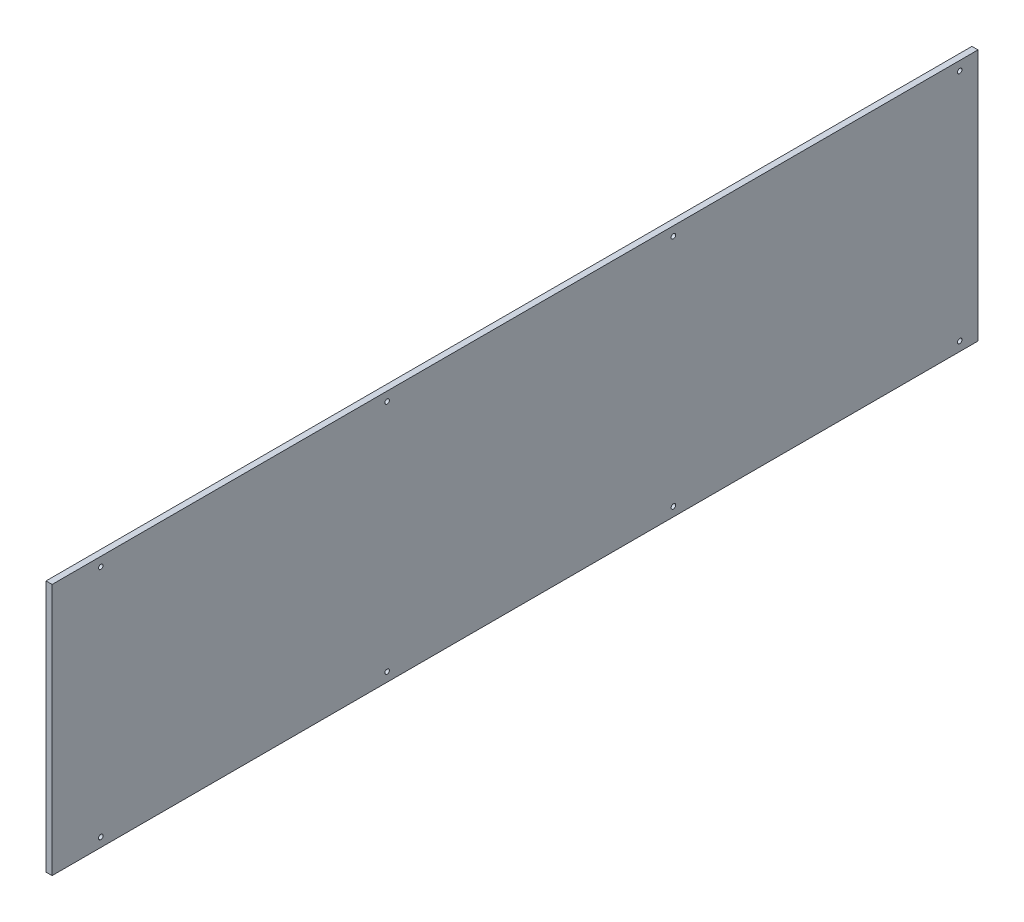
from build123d import *

# Parameters (mm, degrees)
SKETCH1_W         = 1930.4
SKETCH1_H         = 525.78
EXTRUDE1_DEPTH    = 12.7
SKETCH2_R         = 4.7625
BARREL_NUTS_DEPTH = 2001.762369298
LPATTERN1_COUNT   = 4
LPATTERN1_PITCH   = 596.9


with BuildPart() as part:
    # Sketch1 → Extrude1 (new body)
    with BuildSketch(Plane(origin=(0, 0, 0), x_dir=(0, 0, -1), z_dir=(1, 0, 0))):
        with Locations((965.2, 262.89)):
            Rectangle(SKETCH1_W, SKETCH1_H)
    extrude(amount=-EXTRUDE1_DEPTH)

    # Sketch2 → barrel nuts (cut, through all)
    with BuildSketch(Plane(origin=(0, 0, 0), x_dir=(0, 0, -1), z_dir=(1, 0, 0))):
        with Locations((101.6, 506.73)):
            Circle(SKETCH2_R)
        with Locations((101.6, 19.05)):
            Circle(SKETCH2_R)
    barrel_nuts = extrude(amount=-BARREL_NUTS_DEPTH, mode=Mode.SUBTRACT)

    # LPattern1: barrel nuts ×4
    with Locations(*[(0, 0, -i * LPATTERN1_PITCH) for i in range(1, LPATTERN1_COUNT)]):
        add(barrel_nuts, mode=Mode.SUBTRACT)


solid = part.part
